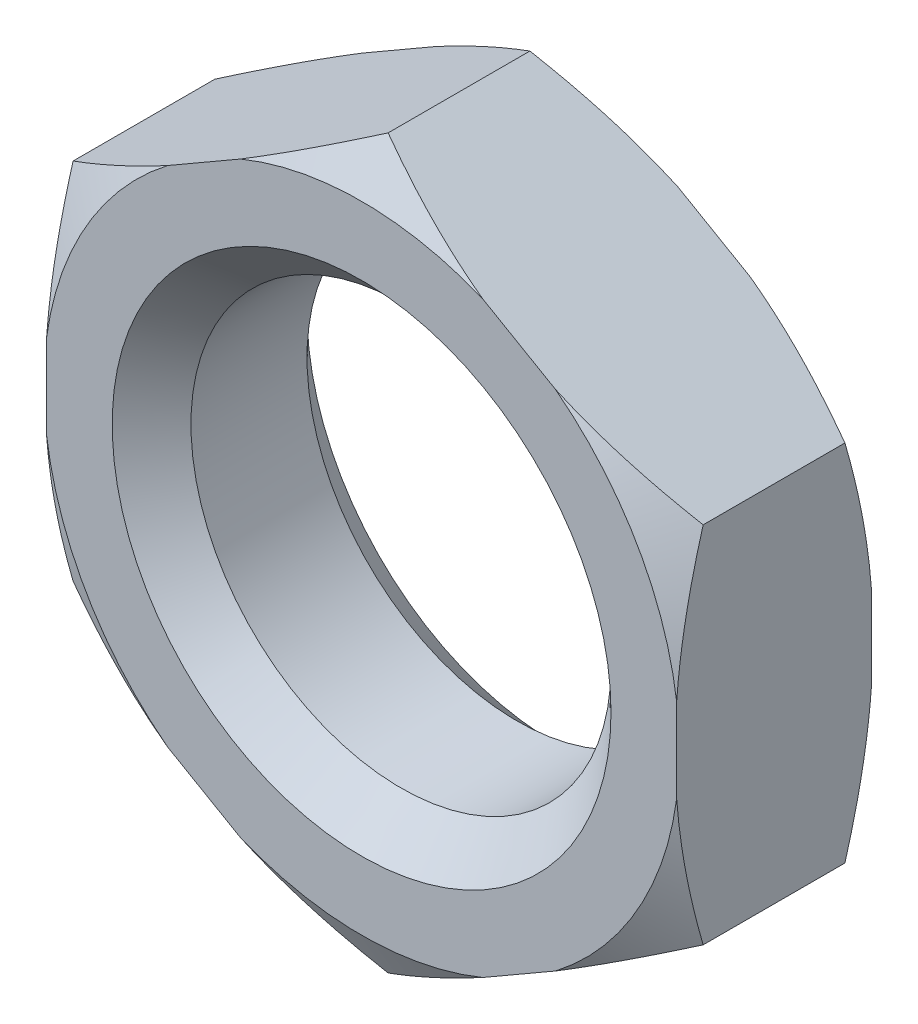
from build123d import *

# Parameters (mm, degrees)
BOSS_EXTRUDE1_DEPTH = 3.71
SKETCH6_R           = 8
CUT_EXTRUDE1_DEPTH  = 7.42
CHAMFER1_SIZE       = 1.5


with BuildPart() as part:
    # Sketch3 → Boss-Extrude1 (new, symmetric)
    with BuildSketch(Plane.XY):
        Polygon((0, 13.856406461), (-12, 6.92820323), (-12, -6.92820323), (0, -13.856406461), (12, -6.92820323), (12, 6.92820323), align=None)
    extrude(amount=BOSS_EXTRUDE1_DEPTH, both=True)

    # Sketch5 → Cut-Revolve1 (revolve, cut)
    with BuildSketch(Plane(origin=(0, 0, 0), x_dir=(0, 0, -1), z_dir=(1, 0, 0))):
        Polygon((-3.71, 13.856406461), (-3.71, 12.106406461), (-2.699637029, 13.856406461), align=None)
    cut_revolve1 = revolve(axis=Axis((0, 0, 5.457798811), (0, 0, -1)), mode=Mode.SUBTRACT)

    # Mirror1: Cut-Revolve1 across plane
    add(cut_revolve1.mirror(Plane.XY), mode=Mode.SUBTRACT)

    # Sketch6 → Cut-Extrude1 (cut)
    with BuildSketch(Plane.XY.offset(3.71)):
        Circle(SKETCH6_R)
    extrude(amount=-CUT_EXTRUDE1_DEPTH, mode=Mode.SUBTRACT)

    # Chamfer1
    chamfer1_edges = [part.edges().sort_by_distance(p)[0] for p in [
        (-8, 0, -3.71),
        (-8, 0, 3.71),
    ]]
    chamfer(chamfer1_edges, length=CHAMFER1_SIZE)


solid = part.part
